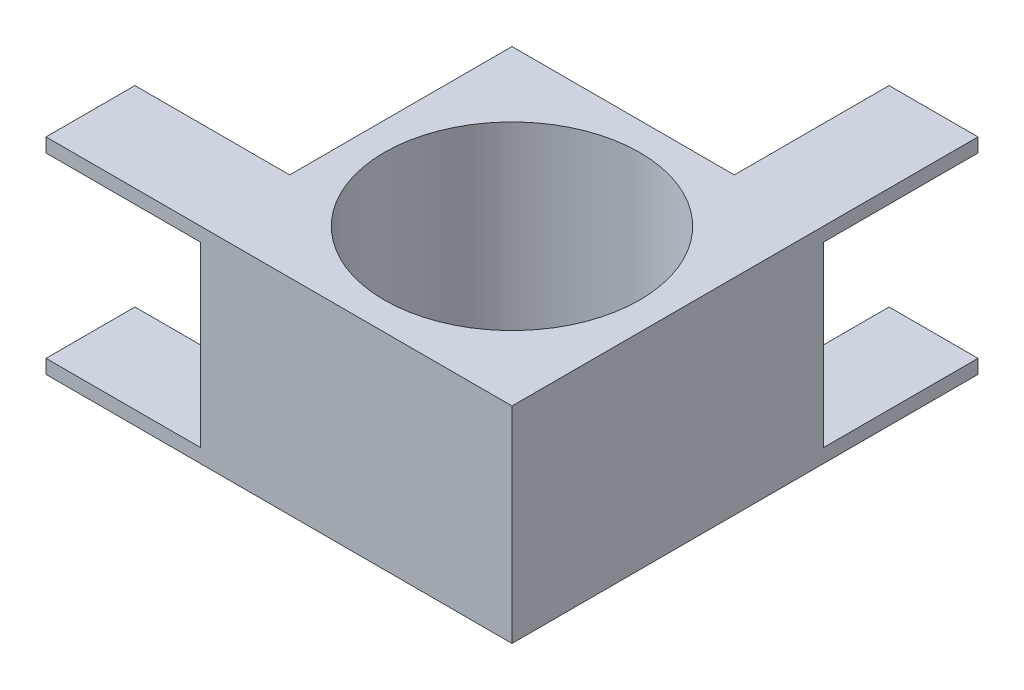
ISO-10303-21;
HEADER;
FILE_DESCRIPTION(('STEP AP214'),'2;1');
FILE_NAME('part.step','',(''),(''),'','','');
FILE_SCHEMA(('AUTOMOTIVE_DESIGN { 1 0 10303 214 1 1 1 1 }'));
ENDSEC;
DATA;
#1=APPLICATION_CONTEXT('core data for automotive mechanical design processes');
#2=APPLICATION_PROTOCOL_DEFINITION('international standard','automotive_design',2000,#1);
#3=PRODUCT_CONTEXT('',#1,'mechanical');
#4=PRODUCT('Part','Part','',(#3));
#5=PRODUCT_RELATED_PRODUCT_CATEGORY('part','',(#4));
#6=PRODUCT_DEFINITION_FORMATION('','',#4);
#7=PRODUCT_DEFINITION_CONTEXT('part definition',#1,'design');
#8=PRODUCT_DEFINITION('design','',#6,#7);
#9=PRODUCT_DEFINITION_SHAPE('','',#8);
#10=(LENGTH_UNIT() NAMED_UNIT(*) SI_UNIT(.MILLI.,.METRE.));
#11=(NAMED_UNIT(*) PLANE_ANGLE_UNIT() SI_UNIT($,.RADIAN.));
#12=(NAMED_UNIT(*) SI_UNIT($,.STERADIAN.) SOLID_ANGLE_UNIT());
#13=UNCERTAINTY_MEASURE_WITH_UNIT(LENGTH_MEASURE(1.E-05),#10,'distance_accuracy_value','');
#14=(GEOMETRIC_REPRESENTATION_CONTEXT(3) GLOBAL_UNCERTAINTY_ASSIGNED_CONTEXT((#13)) GLOBAL_UNIT_ASSIGNED_CONTEXT((#10,
#11,#12)) REPRESENTATION_CONTEXT('',''));
#15=CARTESIAN_POINT('',(0.,0.,0.));
#16=DIRECTION('',(0.,0.,1.));
#17=DIRECTION('',(1.,0.,0.));
#18=AXIS2_PLACEMENT_3D('',#15,#16,#17);
#19=CARTESIAN_POINT('',(-44.45,58.75,-44.45));
#20=DIRECTION('',(0.,0.,1.));
#21=DIRECTION('',(1.,0.,0.));
#22=AXIS2_PLACEMENT_3D('',#19,#20,#21);
#23=PLANE('',#22);
#24=DIRECTION('',(0.,1.,0.));
#25=VECTOR('',#24,1.);
#26=CARTESIAN_POINT('',(19.05,0.,-44.45));
#27=LINE('',#26,#25);
#28=CARTESIAN_POINT('',(19.05,0.,-44.45));
#29=VERTEX_POINT('',#28);
#30=CARTESIAN_POINT('',(19.05,3.975,-44.45));
#31=VERTEX_POINT('',#30);
#32=EDGE_CURVE('E137',#29,#31,#27,.T.);
#33=ORIENTED_EDGE('',*,*,#32,.F.);
#34=DIRECTION('',(-1.,0.,0.));
#35=VECTOR('',#34,1.);
#36=CARTESIAN_POINT('',(-44.45,0.,-44.45));
#37=LINE('',#36,#35);
#38=CARTESIAN_POINT('',(-44.45,0.,-44.45));
#39=VERTEX_POINT('',#38);
#40=EDGE_CURVE('E130',#29,#39,#37,.T.);
#41=ORIENTED_EDGE('',*,*,#40,.T.);
#42=DIRECTION('',(0.,-1.,0.));
#43=VECTOR('',#42,1.);
#44=CARTESIAN_POINT('',(-44.45,58.75,-44.45));
#45=LINE('',#44,#43);
#46=CARTESIAN_POINT('',(-44.45,58.75,-44.45));
#47=VERTEX_POINT('',#46);
#48=EDGE_CURVE('E24',#47,#39,#45,.T.);
#49=ORIENTED_EDGE('',*,*,#48,.F.);
#50=DIRECTION('',(-1.,0.,0.));
#51=VECTOR('',#50,1.);
#52=CARTESIAN_POINT('',(-44.45,58.75,-44.45));
#53=LINE('',#52,#51);
#54=CARTESIAN_POINT('',(19.05,58.75,-44.45));
#55=VERTEX_POINT('',#54);
#56=EDGE_CURVE('E245',#55,#47,#53,.T.);
#57=ORIENTED_EDGE('',*,*,#56,.F.);
#58=DIRECTION('',(0.,1.,0.));
#59=VECTOR('',#58,1.);
#60=CARTESIAN_POINT('',(19.05,58.75,-44.45));
#61=LINE('',#60,#59);
#62=CARTESIAN_POINT('',(19.05,54.775,-44.45));
#63=VERTEX_POINT('',#62);
#64=EDGE_CURVE('E172',#63,#55,#61,.T.);
#65=ORIENTED_EDGE('',*,*,#64,.F.);
#66=DIRECTION('',(-1.,0.,0.));
#67=VECTOR('',#66,1.);
#68=CARTESIAN_POINT('',(44.45,54.775,-44.45));
#69=LINE('',#68,#67);
#70=CARTESIAN_POINT('',(44.45,54.775,-44.45));
#71=VERTEX_POINT('',#70);
#72=EDGE_CURVE('E141',#71,#63,#69,.T.);
#73=ORIENTED_EDGE('',*,*,#72,.F.);
#74=DIRECTION('',(0.,-1.,0.));
#75=VECTOR('',#74,1.);
#76=CARTESIAN_POINT('',(44.45,58.75,-44.45));
#77=LINE('',#76,#75);
#78=CARTESIAN_POINT('',(44.45,3.975,-44.45));
#79=VERTEX_POINT('',#78);
#80=EDGE_CURVE('E11',#71,#79,#77,.T.);
#81=ORIENTED_EDGE('',*,*,#80,.T.);
#82=DIRECTION('',(1.,0.,0.));
#83=VECTOR('',#82,1.);
#84=CARTESIAN_POINT('',(44.45,3.975,-44.45));
#85=LINE('',#84,#83);
#86=EDGE_CURVE('E28',#31,#79,#85,.T.);
#87=ORIENTED_EDGE('',*,*,#86,.F.);
#88=EDGE_LOOP('',(#33,#41,#49,#57,#65,#73,#81,#87));
#89=FACE_BOUND('',#88,.T.);
#90=ADVANCED_FACE('F16',(#89),#23,.F.);
#91=CARTESIAN_POINT('',(-44.45,58.75,-44.45));
#92=DIRECTION('',(1.,0.,0.));
#93=DIRECTION('',(0.,0.,-1.));
#94=AXIS2_PLACEMENT_3D('',#91,#92,#93);
#95=PLANE('',#94);
#96=DIRECTION('',(0.,0.,-1.));
#97=VECTOR('',#96,1.);
#98=CARTESIAN_POINT('',(-44.45,3.975,44.45));
#99=LINE('',#98,#97);
#100=CARTESIAN_POINT('',(-44.45,3.975,44.45));
#101=VERTEX_POINT('',#100);
#102=CARTESIAN_POINT('',(-44.45,3.975,19.05));
#103=VERTEX_POINT('',#102);
#104=EDGE_CURVE('E195',#101,#103,#99,.T.);
#105=ORIENTED_EDGE('',*,*,#104,.F.);
#106=DIRECTION('',(0.,-1.,0.));
#107=VECTOR('',#106,1.);
#108=CARTESIAN_POINT('',(-44.45,58.75,44.45));
#109=LINE('',#108,#107);
#110=CARTESIAN_POINT('',(-44.45,54.775,44.45));
#111=VERTEX_POINT('',#110);
#112=EDGE_CURVE('E258',#111,#101,#109,.T.);
#113=ORIENTED_EDGE('',*,*,#112,.F.);
#114=DIRECTION('',(0.,0.,1.));
#115=VECTOR('',#114,1.);
#116=CARTESIAN_POINT('',(-44.45,54.775,44.45));
#117=LINE('',#116,#115);
#118=CARTESIAN_POINT('',(-44.45,54.775,19.05));
#119=VERTEX_POINT('',#118);
#120=EDGE_CURVE('E222',#119,#111,#117,.T.);
#121=ORIENTED_EDGE('',*,*,#120,.F.);
#122=DIRECTION('',(0.,-1.,0.));
#123=VECTOR('',#122,1.);
#124=CARTESIAN_POINT('',(-44.45,58.75,19.05));
#125=LINE('',#124,#123);
#126=CARTESIAN_POINT('',(-44.45,58.75,19.05));
#127=VERTEX_POINT('',#126);
#128=EDGE_CURVE('E216',#127,#119,#125,.T.);
#129=ORIENTED_EDGE('',*,*,#128,.F.);
#130=DIRECTION('',(0.,0.,1.));
#131=VECTOR('',#130,1.);
#132=CARTESIAN_POINT('',(-44.45,58.75,-44.45));
#133=LINE('',#132,#131);
#134=EDGE_CURVE('E244',#47,#127,#133,.T.);
#135=ORIENTED_EDGE('',*,*,#134,.F.);
#136=ORIENTED_EDGE('',*,*,#48,.T.);
#137=DIRECTION('',(0.,0.,1.));
#138=VECTOR('',#137,1.);
#139=CARTESIAN_POINT('',(-44.45,0.,-44.45));
#140=LINE('',#139,#138);
#141=CARTESIAN_POINT('',(-44.45,0.,19.05));
#142=VERTEX_POINT('',#141);
#143=EDGE_CURVE('E133',#39,#142,#140,.T.);
#144=ORIENTED_EDGE('',*,*,#143,.T.);
#145=DIRECTION('',(0.,-1.,0.));
#146=VECTOR('',#145,1.);
#147=CARTESIAN_POINT('',(-44.45,0.,19.05));
#148=LINE('',#147,#146);
#149=EDGE_CURVE('E197',#103,#142,#148,.T.);
#150=ORIENTED_EDGE('',*,*,#149,.F.);
#151=EDGE_LOOP('',(#105,#113,#121,#129,#135,#136,#144,#150));
#152=FACE_BOUND('',#151,.T.);
#153=ADVANCED_FACE('F257',(#152),#95,.F.);
#154=CARTESIAN_POINT('',(44.45,58.75,-44.45));
#155=DIRECTION('',(-1.,0.,0.));
#156=DIRECTION('',(0.,0.,1.));
#157=AXIS2_PLACEMENT_3D('',#154,#155,#156);
#158=PLANE('',#157);
#159=DIRECTION('',(0.,0.,-1.));
#160=VECTOR('',#159,1.);
#161=CARTESIAN_POINT('',(44.45,0.,-44.45));
#162=LINE('',#161,#160);
#163=CARTESIAN_POINT('',(44.45,0.,44.45));
#164=VERTEX_POINT('',#163);
#165=CARTESIAN_POINT('',(44.45,0.,-88.65));
#166=VERTEX_POINT('',#165);
#167=EDGE_CURVE('E140',#164,#166,#162,.T.);
#168=ORIENTED_EDGE('',*,*,#167,.T.);
#169=DIRECTION('',(0.,-1.,0.));
#170=VECTOR('',#169,1.);
#171=CARTESIAN_POINT('',(44.45,0.,-88.65));
#172=LINE('',#171,#170);
#173=CARTESIAN_POINT('',(44.45,3.975,-88.65));
#174=VERTEX_POINT('',#173);
#175=EDGE_CURVE('E159',#174,#166,#172,.T.);
#176=ORIENTED_EDGE('',*,*,#175,.F.);
#177=DIRECTION('',(0.,0.,1.));
#178=VECTOR('',#177,1.);
#179=CARTESIAN_POINT('',(44.45,3.975,-88.65));
#180=LINE('',#179,#178);
#181=EDGE_CURVE('E147',#174,#79,#180,.T.);
#182=ORIENTED_EDGE('',*,*,#181,.T.);
#183=ORIENTED_EDGE('',*,*,#80,.F.);
#184=DIRECTION('',(0.,0.,1.));
#185=VECTOR('',#184,1.);
#186=CARTESIAN_POINT('',(44.45,54.775,-88.65));
#187=LINE('',#186,#185);
#188=CARTESIAN_POINT('',(44.45,54.775,-88.65));
#189=VERTEX_POINT('',#188);
#190=EDGE_CURVE('E188',#189,#71,#187,.T.);
#191=ORIENTED_EDGE('',*,*,#190,.F.);
#192=DIRECTION('',(0.,-1.,0.));
#193=VECTOR('',#192,1.);
#194=CARTESIAN_POINT('',(44.45,58.75,-88.65));
#195=LINE('',#194,#193);
#196=CARTESIAN_POINT('',(44.45,58.75,-88.65));
#197=VERTEX_POINT('',#196);
#198=EDGE_CURVE('E169',#197,#189,#195,.T.);
#199=ORIENTED_EDGE('',*,*,#198,.F.);
#200=DIRECTION('',(0.,0.,-1.));
#201=VECTOR('',#200,1.);
#202=CARTESIAN_POINT('',(44.45,58.75,-44.45));
#203=LINE('',#202,#201);
#204=CARTESIAN_POINT('',(44.45,58.75,44.45));
#205=VERTEX_POINT('',#204);
#206=EDGE_CURVE('E239',#205,#197,#203,.T.);
#207=ORIENTED_EDGE('',*,*,#206,.F.);
#208=DIRECTION('',(0.,-1.,0.));
#209=VECTOR('',#208,1.);
#210=CARTESIAN_POINT('',(44.45,58.75,44.45));
#211=LINE('',#210,#209);
#212=EDGE_CURVE('E249',#205,#164,#211,.T.);
#213=ORIENTED_EDGE('',*,*,#212,.T.);
#214=EDGE_LOOP('',(#168,#176,#182,#183,#191,#199,#207,#213));
#215=FACE_BOUND('',#214,.T.);
#216=ADVANCED_FACE('F18',(#215),#158,.F.);
#217=CARTESIAN_POINT('',(-44.45,58.75,44.45));
#218=DIRECTION('',(0.,0.,-1.));
#219=DIRECTION('',(-1.,0.,0.));
#220=AXIS2_PLACEMENT_3D('',#217,#218,#219);
#221=PLANE('',#220);
#222=DIRECTION('',(1.,0.,0.));
#223=VECTOR('',#222,1.);
#224=CARTESIAN_POINT('',(-44.45,0.,44.45));
#225=LINE('',#224,#223);
#226=CARTESIAN_POINT('',(-88.65,0.,44.45));
#227=VERTEX_POINT('',#226);
#228=EDGE_CURVE('E242',#227,#164,#225,.T.);
#229=ORIENTED_EDGE('',*,*,#228,.T.);
#230=ORIENTED_EDGE('',*,*,#212,.F.);
#231=DIRECTION('',(1.,0.,0.));
#232=VECTOR('',#231,1.);
#233=CARTESIAN_POINT('',(-44.45,58.75,44.45));
#234=LINE('',#233,#232);
#235=CARTESIAN_POINT('',(-88.65,58.75,44.45));
#236=VERTEX_POINT('',#235);
#237=EDGE_CURVE('E248',#236,#205,#234,.T.);
#238=ORIENTED_EDGE('',*,*,#237,.F.);
#239=DIRECTION('',(0.,1.,0.));
#240=VECTOR('',#239,1.);
#241=CARTESIAN_POINT('',(-88.65,58.75,44.45));
#242=LINE('',#241,#240);
#243=CARTESIAN_POINT('',(-88.65,54.775,44.45));
#244=VERTEX_POINT('',#243);
#245=EDGE_CURVE('E220',#244,#236,#242,.T.);
#246=ORIENTED_EDGE('',*,*,#245,.F.);
#247=DIRECTION('',(1.,0.,0.));
#248=VECTOR('',#247,1.);
#249=CARTESIAN_POINT('',(-88.65,54.775,44.45));
#250=LINE('',#249,#248);
#251=EDGE_CURVE('E227',#244,#111,#250,.T.);
#252=ORIENTED_EDGE('',*,*,#251,.T.);
#253=ORIENTED_EDGE('',*,*,#112,.T.);
#254=DIRECTION('',(1.,0.,0.));
#255=VECTOR('',#254,1.);
#256=CARTESIAN_POINT('',(-88.65,3.975,44.45));
#257=LINE('',#256,#255);
#258=CARTESIAN_POINT('',(-88.65,3.975,44.45));
#259=VERTEX_POINT('',#258);
#260=EDGE_CURVE('E213',#259,#101,#257,.T.);
#261=ORIENTED_EDGE('',*,*,#260,.F.);
#262=DIRECTION('',(0.,1.,0.));
#263=VECTOR('',#262,1.);
#264=CARTESIAN_POINT('',(-88.65,0.,44.45));
#265=LINE('',#264,#263);
#266=EDGE_CURVE('E193',#227,#259,#265,.T.);
#267=ORIENTED_EDGE('',*,*,#266,.F.);
#268=EDGE_LOOP('',(#229,#230,#238,#246,#252,#253,#261,#267));
#269=FACE_BOUND('',#268,.T.);
#270=ADVANCED_FACE('F300',(#269),#221,.F.);
#271=CARTESIAN_POINT('',(0.,58.75,0.));
#272=DIRECTION('',(0.,1.,0.));
#273=DIRECTION('',(0.,0.,1.));
#274=AXIS2_PLACEMENT_3D('',#271,#272,#273);
#275=PLANE('',#274);
#276=CARTESIAN_POINT('',(0.,58.75,0.));
#277=DIRECTION('',(0.,-1.,0.));
#278=DIRECTION('',(0.,0.,-1.));
#279=AXIS2_PLACEMENT_3D('',#276,#277,#278);
#280=CIRCLE('',#279,36.5);
#281=CARTESIAN_POINT('',(0.,58.75,-36.5));
#282=VERTEX_POINT('',#281);
#283=EDGE_CURVE('E146',#282,#282,#280,.T.);
#284=ORIENTED_EDGE('',*,*,#283,.T.);
#285=EDGE_LOOP('',(#284));
#286=FACE_BOUND('',#285,.T.);
#287=ORIENTED_EDGE('',*,*,#206,.T.);
#288=DIRECTION('',(1.,0.,0.));
#289=VECTOR('',#288,1.);
#290=CARTESIAN_POINT('',(44.45,58.75,-88.65));
#291=LINE('',#290,#289);
#292=CARTESIAN_POINT('',(19.05,58.75,-88.65));
#293=VERTEX_POINT('',#292);
#294=EDGE_CURVE('E176',#293,#197,#291,.T.);
#295=ORIENTED_EDGE('',*,*,#294,.F.);
#296=DIRECTION('',(0.,0.,1.));
#297=VECTOR('',#296,1.);
#298=CARTESIAN_POINT('',(19.05,58.75,-88.65));
#299=LINE('',#298,#297);
#300=EDGE_CURVE('E177',#293,#55,#299,.T.);
#301=ORIENTED_EDGE('',*,*,#300,.T.);
#302=ORIENTED_EDGE('',*,*,#56,.T.);
#303=ORIENTED_EDGE('',*,*,#134,.T.);
#304=DIRECTION('',(1.,0.,0.));
#305=VECTOR('',#304,1.);
#306=CARTESIAN_POINT('',(-88.65,58.75,19.05));
#307=LINE('',#306,#305);
#308=CARTESIAN_POINT('',(-88.65,58.75,19.05));
#309=VERTEX_POINT('',#308);
#310=EDGE_CURVE('E236',#309,#127,#307,.T.);
#311=ORIENTED_EDGE('',*,*,#310,.F.);
#312=DIRECTION('',(0.,0.,-1.));
#313=VECTOR('',#312,1.);
#314=CARTESIAN_POINT('',(-88.65,58.75,44.45));
#315=LINE('',#314,#313);
#316=EDGE_CURVE('E219',#236,#309,#315,.T.);
#317=ORIENTED_EDGE('',*,*,#316,.F.);
#318=ORIENTED_EDGE('',*,*,#237,.T.);
#319=EDGE_LOOP('',(#287,#295,#301,#302,#303,#311,#317,#318));
#320=FACE_BOUND('',#319,.T.);
#321=ADVANCED_FACE('F268',(#286,#320),#275,.T.);
#322=CARTESIAN_POINT('',(0.,0.,0.));
#323=DIRECTION('',(0.,1.,0.));
#324=DIRECTION('',(0.,0.,1.));
#325=AXIS2_PLACEMENT_3D('',#322,#323,#324);
#326=PLANE('',#325);
#327=CARTESIAN_POINT('',(0.,0.,0.));
#328=DIRECTION('',(0.,-1.,0.));
#329=DIRECTION('',(0.,0.,-1.));
#330=AXIS2_PLACEMENT_3D('',#327,#328,#329);
#331=CIRCLE('',#330,36.5);
#332=CARTESIAN_POINT('',(0.,0.,-36.5));
#333=VERTEX_POINT('',#332);
#334=EDGE_CURVE('E153',#333,#333,#331,.T.);
#335=ORIENTED_EDGE('',*,*,#334,.F.);
#336=EDGE_LOOP('',(#335));
#337=FACE_BOUND('',#336,.T.);
#338=ORIENTED_EDGE('',*,*,#167,.F.);
#339=ORIENTED_EDGE('',*,*,#228,.F.);
#340=DIRECTION('',(0.,0.,1.));
#341=VECTOR('',#340,1.);
#342=CARTESIAN_POINT('',(-88.65,0.,44.45));
#343=LINE('',#342,#341);
#344=CARTESIAN_POINT('',(-88.65,0.,19.05));
#345=VERTEX_POINT('',#344);
#346=EDGE_CURVE('E203',#345,#227,#343,.T.);
#347=ORIENTED_EDGE('',*,*,#346,.F.);
#348=DIRECTION('',(1.,0.,0.));
#349=VECTOR('',#348,1.);
#350=CARTESIAN_POINT('',(-88.65,0.,19.05));
#351=LINE('',#350,#349);
#352=EDGE_CURVE('E204',#345,#142,#351,.T.);
#353=ORIENTED_EDGE('',*,*,#352,.T.);
#354=ORIENTED_EDGE('',*,*,#143,.F.);
#355=ORIENTED_EDGE('',*,*,#40,.F.);
#356=DIRECTION('',(0.,0.,1.));
#357=VECTOR('',#356,1.);
#358=CARTESIAN_POINT('',(19.05,0.,-88.65));
#359=LINE('',#358,#357);
#360=CARTESIAN_POINT('',(19.05,0.,-88.65));
#361=VERTEX_POINT('',#360);
#362=EDGE_CURVE('E131',#361,#29,#359,.T.);
#363=ORIENTED_EDGE('',*,*,#362,.F.);
#364=DIRECTION('',(-1.,0.,0.));
#365=VECTOR('',#364,1.);
#366=CARTESIAN_POINT('',(44.45,0.,-88.65));
#367=LINE('',#366,#365);
#368=EDGE_CURVE('E163',#166,#361,#367,.T.);
#369=ORIENTED_EDGE('',*,*,#368,.F.);
#370=EDGE_LOOP('',(#338,#339,#347,#353,#354,#355,#363,#369));
#371=FACE_BOUND('',#370,.T.);
#372=ADVANCED_FACE('F128',(#337,#371),#326,.F.);
#373=CARTESIAN_POINT('',(-88.65,58.75,19.05));
#374=DIRECTION('',(0.,0.,1.));
#375=DIRECTION('',(1.,0.,0.));
#376=AXIS2_PLACEMENT_3D('',#373,#374,#375);
#377=PLANE('',#376);
#378=ORIENTED_EDGE('',*,*,#128,.T.);
#379=DIRECTION('',(1.,0.,0.));
#380=VECTOR('',#379,1.);
#381=CARTESIAN_POINT('',(-88.65,54.775,19.05));
#382=LINE('',#381,#380);
#383=CARTESIAN_POINT('',(-88.65,54.775,19.05));
#384=VERTEX_POINT('',#383);
#385=EDGE_CURVE('E232',#384,#119,#382,.T.);
#386=ORIENTED_EDGE('',*,*,#385,.F.);
#387=DIRECTION('',(0.,-1.,0.));
#388=VECTOR('',#387,1.);
#389=CARTESIAN_POINT('',(-88.65,58.75,19.05));
#390=LINE('',#389,#388);
#391=EDGE_CURVE('E224',#309,#384,#390,.T.);
#392=ORIENTED_EDGE('',*,*,#391,.F.);
#393=ORIENTED_EDGE('',*,*,#310,.T.);
#394=EDGE_LOOP('',(#378,#386,#392,#393));
#395=FACE_BOUND('',#394,.T.);
#396=ADVANCED_FACE('F303',(#395),#377,.F.);
#397=CARTESIAN_POINT('',(-88.65,54.775,44.45));
#398=DIRECTION('',(0.,1.,0.));
#399=DIRECTION('',(0.,0.,1.));
#400=AXIS2_PLACEMENT_3D('',#397,#398,#399);
#401=PLANE('',#400);
#402=ORIENTED_EDGE('',*,*,#120,.T.);
#403=ORIENTED_EDGE('',*,*,#251,.F.);
#404=DIRECTION('',(0.,0.,1.));
#405=VECTOR('',#404,1.);
#406=CARTESIAN_POINT('',(-88.65,54.775,44.45));
#407=LINE('',#406,#405);
#408=EDGE_CURVE('E223',#384,#244,#407,.T.);
#409=ORIENTED_EDGE('',*,*,#408,.F.);
#410=ORIENTED_EDGE('',*,*,#385,.T.);
#411=EDGE_LOOP('',(#402,#403,#409,#410));
#412=FACE_BOUND('',#411,.T.);
#413=ADVANCED_FACE('F309',(#412),#401,.F.);
#414=CARTESIAN_POINT('',(-88.65,0.,0.));
#415=DIRECTION('',(1.,0.,0.));
#416=DIRECTION('',(0.,0.,-1.));
#417=AXIS2_PLACEMENT_3D('',#414,#415,#416);
#418=PLANE('',#417);
#419=ORIENTED_EDGE('',*,*,#245,.T.);
#420=ORIENTED_EDGE('',*,*,#316,.T.);
#421=ORIENTED_EDGE('',*,*,#391,.T.);
#422=ORIENTED_EDGE('',*,*,#408,.T.);
#423=EDGE_LOOP('',(#419,#420,#421,#422));
#424=FACE_BOUND('',#423,.T.);
#425=ADVANCED_FACE('F314',(#424),#418,.F.);
#426=CARTESIAN_POINT('',(-88.65,3.975,44.45));
#427=DIRECTION('',(0.,-1.,0.));
#428=DIRECTION('',(0.,0.,-1.));
#429=AXIS2_PLACEMENT_3D('',#426,#427,#428);
#430=PLANE('',#429);
#431=ORIENTED_EDGE('',*,*,#104,.T.);
#432=DIRECTION('',(1.,0.,0.));
#433=VECTOR('',#432,1.);
#434=CARTESIAN_POINT('',(-88.65,3.975,19.05));
#435=LINE('',#434,#433);
#436=CARTESIAN_POINT('',(-88.65,3.975,19.05));
#437=VERTEX_POINT('',#436);
#438=EDGE_CURVE('E209',#437,#103,#435,.T.);
#439=ORIENTED_EDGE('',*,*,#438,.F.);
#440=DIRECTION('',(0.,0.,-1.));
#441=VECTOR('',#440,1.);
#442=CARTESIAN_POINT('',(-88.65,3.975,44.45));
#443=LINE('',#442,#441);
#444=EDGE_CURVE('E198',#259,#437,#443,.T.);
#445=ORIENTED_EDGE('',*,*,#444,.F.);
#446=ORIENTED_EDGE('',*,*,#260,.T.);
#447=EDGE_LOOP('',(#431,#439,#445,#446));
#448=FACE_BOUND('',#447,.T.);
#449=ADVANCED_FACE('F318',(#448),#430,.F.);
#450=CARTESIAN_POINT('',(-88.65,0.,19.05));
#451=DIRECTION('',(0.,0.,1.));
#452=DIRECTION('',(1.,0.,0.));
#453=AXIS2_PLACEMENT_3D('',#450,#451,#452);
#454=PLANE('',#453);
#455=ORIENTED_EDGE('',*,*,#149,.T.);
#456=ORIENTED_EDGE('',*,*,#352,.F.);
#457=DIRECTION('',(0.,-1.,0.));
#458=VECTOR('',#457,1.);
#459=CARTESIAN_POINT('',(-88.65,0.,19.05));
#460=LINE('',#459,#458);
#461=EDGE_CURVE('E200',#437,#345,#460,.T.);
#462=ORIENTED_EDGE('',*,*,#461,.F.);
#463=ORIENTED_EDGE('',*,*,#438,.T.);
#464=EDGE_LOOP('',(#455,#456,#462,#463));
#465=FACE_BOUND('',#464,.T.);
#466=ADVANCED_FACE('F290',(#465),#454,.F.);
#467=CARTESIAN_POINT('',(-88.65,0.,0.));
#468=DIRECTION('',(-1.,0.,0.));
#469=DIRECTION('',(0.,0.,1.));
#470=AXIS2_PLACEMENT_3D('',#467,#468,#469);
#471=PLANE('',#470);
#472=ORIENTED_EDGE('',*,*,#266,.T.);
#473=ORIENTED_EDGE('',*,*,#444,.T.);
#474=ORIENTED_EDGE('',*,*,#461,.T.);
#475=ORIENTED_EDGE('',*,*,#346,.T.);
#476=EDGE_LOOP('',(#472,#473,#474,#475));
#477=FACE_BOUND('',#476,.T.);
#478=ADVANCED_FACE('F279',(#477),#471,.T.);
#479=CARTESIAN_POINT('',(44.45,54.775,-88.65));
#480=DIRECTION('',(0.,1.,0.));
#481=DIRECTION('',(0.,0.,1.));
#482=AXIS2_PLACEMENT_3D('',#479,#480,#481);
#483=PLANE('',#482);
#484=ORIENTED_EDGE('',*,*,#72,.T.);
#485=DIRECTION('',(0.,0.,1.));
#486=VECTOR('',#485,1.);
#487=CARTESIAN_POINT('',(19.05,54.775,-88.65));
#488=LINE('',#487,#486);
#489=CARTESIAN_POINT('',(19.05,54.775,-88.65));
#490=VERTEX_POINT('',#489);
#491=EDGE_CURVE('E186',#490,#63,#488,.T.);
#492=ORIENTED_EDGE('',*,*,#491,.F.);
#493=DIRECTION('',(-1.,0.,0.));
#494=VECTOR('',#493,1.);
#495=CARTESIAN_POINT('',(44.45,54.775,-88.65));
#496=LINE('',#495,#494);
#497=EDGE_CURVE('E171',#189,#490,#496,.T.);
#498=ORIENTED_EDGE('',*,*,#497,.F.);
#499=ORIENTED_EDGE('',*,*,#190,.T.);
#500=EDGE_LOOP('',(#484,#492,#498,#499));
#501=FACE_BOUND('',#500,.T.);
#502=ADVANCED_FACE('F277',(#501),#483,.F.);
#503=CARTESIAN_POINT('',(19.05,58.75,-88.65));
#504=DIRECTION('',(1.,0.,0.));
#505=DIRECTION('',(0.,0.,-1.));
#506=AXIS2_PLACEMENT_3D('',#503,#504,#505);
#507=PLANE('',#506);
#508=ORIENTED_EDGE('',*,*,#64,.T.);
#509=ORIENTED_EDGE('',*,*,#300,.F.);
#510=DIRECTION('',(0.,1.,0.));
#511=VECTOR('',#510,1.);
#512=CARTESIAN_POINT('',(19.05,58.75,-88.65));
#513=LINE('',#512,#511);
#514=EDGE_CURVE('E173',#490,#293,#513,.T.);
#515=ORIENTED_EDGE('',*,*,#514,.F.);
#516=ORIENTED_EDGE('',*,*,#491,.T.);
#517=EDGE_LOOP('',(#508,#509,#515,#516));
#518=FACE_BOUND('',#517,.T.);
#519=ADVANCED_FACE('F262',(#518),#507,.F.);
#520=CARTESIAN_POINT('',(0.,0.,-88.65));
#521=DIRECTION('',(0.,0.,-1.));
#522=DIRECTION('',(-1.,0.,0.));
#523=AXIS2_PLACEMENT_3D('',#520,#521,#522);
#524=PLANE('',#523);
#525=ORIENTED_EDGE('',*,*,#198,.T.);
#526=ORIENTED_EDGE('',*,*,#497,.T.);
#527=ORIENTED_EDGE('',*,*,#514,.T.);
#528=ORIENTED_EDGE('',*,*,#294,.T.);
#529=EDGE_LOOP('',(#525,#526,#527,#528));
#530=FACE_BOUND('',#529,.T.);
#531=ADVANCED_FACE('F275',(#530),#524,.T.);
#532=CARTESIAN_POINT('',(19.05,0.,-88.65));
#533=DIRECTION('',(1.,0.,0.));
#534=DIRECTION('',(0.,0.,-1.));
#535=AXIS2_PLACEMENT_3D('',#532,#533,#534);
#536=PLANE('',#535);
#537=ORIENTED_EDGE('',*,*,#32,.T.);
#538=DIRECTION('',(0.,0.,1.));
#539=VECTOR('',#538,1.);
#540=CARTESIAN_POINT('',(19.05,3.975,-88.65));
#541=LINE('',#540,#539);
#542=CARTESIAN_POINT('',(19.05,3.975,-88.65));
#543=VERTEX_POINT('',#542);
#544=EDGE_CURVE('E150',#543,#31,#541,.T.);
#545=ORIENTED_EDGE('',*,*,#544,.F.);
#546=DIRECTION('',(0.,1.,0.));
#547=VECTOR('',#546,1.);
#548=CARTESIAN_POINT('',(19.05,0.,-88.65));
#549=LINE('',#548,#547);
#550=EDGE_CURVE('E148',#361,#543,#549,.T.);
#551=ORIENTED_EDGE('',*,*,#550,.F.);
#552=ORIENTED_EDGE('',*,*,#362,.T.);
#553=EDGE_LOOP('',(#537,#545,#551,#552));
#554=FACE_BOUND('',#553,.T.);
#555=ADVANCED_FACE('F144',(#554),#536,.F.);
#556=CARTESIAN_POINT('',(44.45,3.975,-88.65));
#557=DIRECTION('',(0.,-1.,0.));
#558=DIRECTION('',(0.,0.,-1.));
#559=AXIS2_PLACEMENT_3D('',#556,#557,#558);
#560=PLANE('',#559);
#561=ORIENTED_EDGE('',*,*,#86,.T.);
#562=ORIENTED_EDGE('',*,*,#181,.F.);
#563=DIRECTION('',(1.,0.,0.));
#564=VECTOR('',#563,1.);
#565=CARTESIAN_POINT('',(44.45,3.975,-88.65));
#566=LINE('',#565,#564);
#567=EDGE_CURVE('E157',#543,#174,#566,.T.);
#568=ORIENTED_EDGE('',*,*,#567,.F.);
#569=ORIENTED_EDGE('',*,*,#544,.T.);
#570=EDGE_LOOP('',(#561,#562,#568,#569));
#571=FACE_BOUND('',#570,.T.);
#572=ADVANCED_FACE('F348',(#571),#560,.F.);
#573=CARTESIAN_POINT('',(0.,0.,-88.65));
#574=DIRECTION('',(0.,0.,1.));
#575=DIRECTION('',(1.,0.,0.));
#576=AXIS2_PLACEMENT_3D('',#573,#574,#575);
#577=PLANE('',#576);
#578=ORIENTED_EDGE('',*,*,#175,.T.);
#579=ORIENTED_EDGE('',*,*,#368,.T.);
#580=ORIENTED_EDGE('',*,*,#550,.T.);
#581=ORIENTED_EDGE('',*,*,#567,.T.);
#582=EDGE_LOOP('',(#578,#579,#580,#581));
#583=FACE_BOUND('',#582,.T.);
#584=ADVANCED_FACE('F342',(#583),#577,.F.);
#585=CARTESIAN_POINT('',(0.,58.75,0.));
#586=DIRECTION('',(0.,-1.,0.));
#587=DIRECTION('',(0.,0.,-1.));
#588=AXIS2_PLACEMENT_3D('',#585,#586,#587);
#589=CYLINDRICAL_SURFACE('',#588,36.5);
#590=ORIENTED_EDGE('',*,*,#283,.F.);
#591=EDGE_LOOP('',(#590));
#592=FACE_BOUND('',#591,.T.);
#593=ORIENTED_EDGE('',*,*,#334,.T.);
#594=EDGE_LOOP('',(#593));
#595=FACE_BOUND('',#594,.T.);
#596=ADVANCED_FACE('F356',(#592,#595),#589,.F.);
#597=CLOSED_SHELL('',(#90,#153,#216,#270,#321,#372,#396,#413,#425,#449,#466,#478,#502,#519,#531,
#555,#572,#584,#596));
#598=MANIFOLD_SOLID_BREP('B1',#597);
#599=ADVANCED_BREP_SHAPE_REPRESENTATION('',(#18,#598),#14);
#600=SHAPE_DEFINITION_REPRESENTATION(#9,#599);
ENDSEC;
END-ISO-10303-21;
